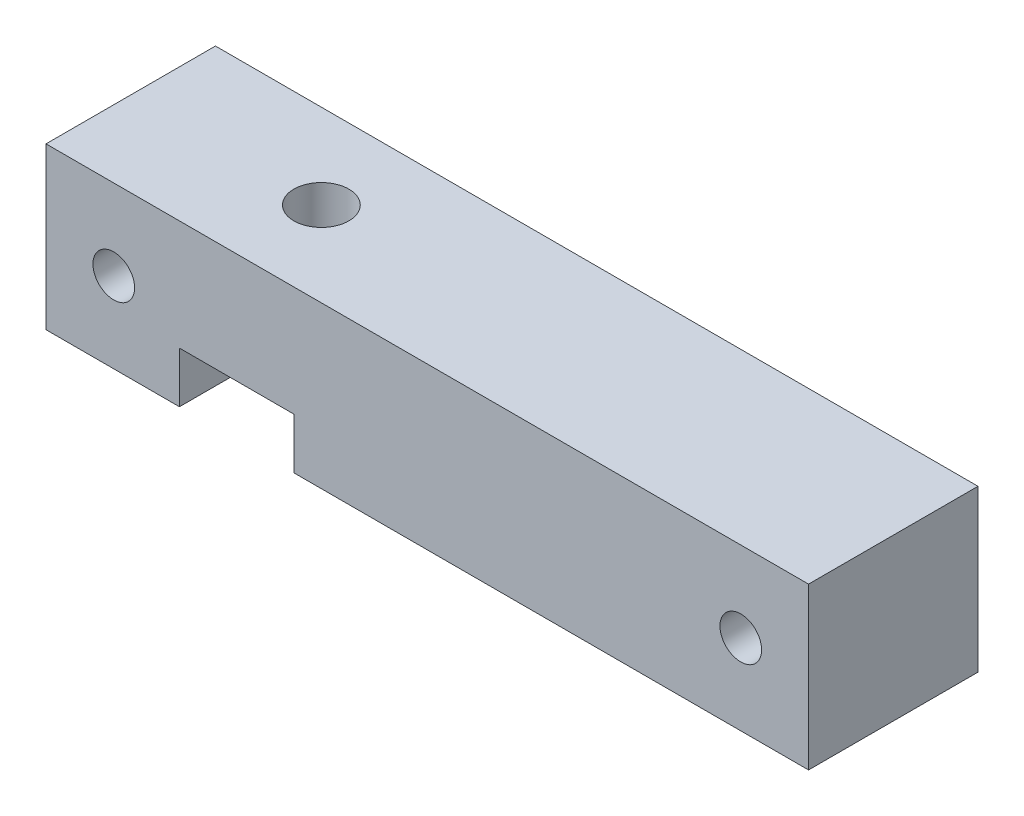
ISO-10303-21;
HEADER;
FILE_DESCRIPTION(('STEP AP214'),'2;1');
FILE_NAME('part.step','',(''),(''),'','','');
FILE_SCHEMA(('AUTOMOTIVE_DESIGN { 1 0 10303 214 1 1 1 1 }'));
ENDSEC;
DATA;
#1=APPLICATION_CONTEXT('core data for automotive mechanical design processes');
#2=APPLICATION_PROTOCOL_DEFINITION('international standard','automotive_design',2000,#1);
#3=PRODUCT_CONTEXT('',#1,'mechanical');
#4=PRODUCT('Part','Part','',(#3));
#5=PRODUCT_RELATED_PRODUCT_CATEGORY('part','',(#4));
#6=PRODUCT_DEFINITION_FORMATION('','',#4);
#7=PRODUCT_DEFINITION_CONTEXT('part definition',#1,'design');
#8=PRODUCT_DEFINITION('design','',#6,#7);
#9=PRODUCT_DEFINITION_SHAPE('','',#8);
#10=(LENGTH_UNIT() NAMED_UNIT(*) SI_UNIT(.MILLI.,.METRE.));
#11=(NAMED_UNIT(*) PLANE_ANGLE_UNIT() SI_UNIT($,.RADIAN.));
#12=(NAMED_UNIT(*) SI_UNIT($,.STERADIAN.) SOLID_ANGLE_UNIT());
#13=UNCERTAINTY_MEASURE_WITH_UNIT(LENGTH_MEASURE(1.E-05),#10,'distance_accuracy_value','');
#14=(GEOMETRIC_REPRESENTATION_CONTEXT(3) GLOBAL_UNCERTAINTY_ASSIGNED_CONTEXT((#13)) GLOBAL_UNIT_ASSIGNED_CONTEXT((#10,
#11,#12)) REPRESENTATION_CONTEXT('',''));
#15=CARTESIAN_POINT('',(0.,0.,0.));
#16=DIRECTION('',(0.,0.,1.));
#17=DIRECTION('',(1.,0.,0.));
#18=AXIS2_PLACEMENT_3D('',#15,#16,#17);
#19=CARTESIAN_POINT('',(-22.5,-1.5,-10.));
#20=DIRECTION('',(0.,-1.,0.));
#21=DIRECTION('',(0.,0.,-1.));
#22=AXIS2_PLACEMENT_3D('',#19,#20,#21);
#23=CYLINDRICAL_SURFACE('',#22,4.25);
#24=CARTESIAN_POINT('',(-22.5,0.5,-10.));
#25=DIRECTION('',(0.,-1.,0.));
#26=DIRECTION('',(0.,0.,-1.));
#27=AXIS2_PLACEMENT_3D('',#24,#25,#26);
#28=CIRCLE('',#27,4.25);
#29=CARTESIAN_POINT('',(-22.5,0.5,-14.25));
#30=VERTEX_POINT('',#29);
#31=EDGE_CURVE('E91',#30,#30,#28,.T.);
#32=ORIENTED_EDGE('',*,*,#31,.F.);
#33=EDGE_LOOP('',(#32));
#34=FACE_BOUND('',#33,.T.);
#35=CARTESIAN_POINT('',(-22.5,-3.5,-10.));
#36=DIRECTION('',(0.,-1.,0.));
#37=DIRECTION('',(0.,0.,-1.));
#38=AXIS2_PLACEMENT_3D('',#35,#36,#37);
#39=CIRCLE('',#38,4.25);
#40=CARTESIAN_POINT('',(-22.5,-3.5,-14.25));
#41=VERTEX_POINT('',#40);
#42=EDGE_CURVE('E18',#41,#41,#39,.F.);
#43=ORIENTED_EDGE('',*,*,#42,.F.);
#44=EDGE_LOOP('',(#43));
#45=FACE_BOUND('',#44,.T.);
#46=ADVANCED_FACE('F15',(#34,#45),#23,.F.);
#47=CARTESIAN_POINT('',(-15.75,-3.5,0.));
#48=DIRECTION('',(-1.,0.,0.));
#49=DIRECTION('',(0.,0.,1.));
#50=AXIS2_PLACEMENT_3D('',#47,#48,#49);
#51=PLANE('',#50);
#52=DIRECTION('',(0.,1.,0.));
#53=VECTOR('',#52,1.);
#54=CARTESIAN_POINT('',(-15.75,0.01304347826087,0.));
#55=LINE('',#54,#53);
#56=CARTESIAN_POINT('',(-15.75,-3.5,0.));
#57=VERTEX_POINT('',#56);
#58=CARTESIAN_POINT('',(-15.75,-9.5,0.));
#59=VERTEX_POINT('',#58);
#60=EDGE_CURVE('E168',#57,#59,#55,.F.);
#61=ORIENTED_EDGE('',*,*,#60,.F.);
#62=DIRECTION('',(0.,0.,-1.));
#63=VECTOR('',#62,1.);
#64=CARTESIAN_POINT('',(-15.75,-3.5,0.));
#65=LINE('',#64,#63);
#66=CARTESIAN_POINT('',(-15.75,-3.5,-20.));
#67=VERTEX_POINT('',#66);
#68=EDGE_CURVE('E97',#67,#57,#65,.F.);
#69=ORIENTED_EDGE('',*,*,#68,.F.);
#70=DIRECTION('',(0.,1.,0.));
#71=VECTOR('',#70,1.);
#72=CARTESIAN_POINT('',(-15.75,0.01304347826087,-20.));
#73=LINE('',#72,#71);
#74=CARTESIAN_POINT('',(-15.75,-9.5,-20.));
#75=VERTEX_POINT('',#74);
#76=EDGE_CURVE('E105',#67,#75,#73,.F.);
#77=ORIENTED_EDGE('',*,*,#76,.T.);
#78=DIRECTION('',(0.,0.,-1.));
#79=VECTOR('',#78,1.);
#80=CARTESIAN_POINT('',(-15.75,-9.5,0.));
#81=LINE('',#80,#79);
#82=EDGE_CURVE('E109',#59,#75,#81,.T.);
#83=ORIENTED_EDGE('',*,*,#82,.F.);
#84=EDGE_LOOP('',(#61,#69,#77,#83));
#85=FACE_BOUND('',#84,.T.);
#86=ADVANCED_FACE('F144',(#85),#51,.T.);
#87=CARTESIAN_POINT('',(-45.,-9.5,0.));
#88=DIRECTION('',(0.,-1.,0.));
#89=DIRECTION('',(0.,0.,-1.));
#90=AXIS2_PLACEMENT_3D('',#87,#88,#89);
#91=PLANE('',#90);
#92=DIRECTION('',(1.,0.,0.));
#93=VECTOR('',#92,1.);
#94=CARTESIAN_POINT('',(-1.17391304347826,-9.5,0.));
#95=LINE('',#94,#93);
#96=CARTESIAN_POINT('',(-45.,-9.5,0.));
#97=VERTEX_POINT('',#96);
#98=CARTESIAN_POINT('',(-29.25,-9.5,0.));
#99=VERTEX_POINT('',#98);
#100=EDGE_CURVE('E159',#97,#99,#95,.T.);
#101=ORIENTED_EDGE('',*,*,#100,.F.);
#102=DIRECTION('',(0.,0.,1.));
#103=VECTOR('',#102,1.);
#104=CARTESIAN_POINT('',(-45.,-9.5,0.));
#105=LINE('',#104,#103);
#106=CARTESIAN_POINT('',(-45.,-9.5,-20.));
#107=VERTEX_POINT('',#106);
#108=EDGE_CURVE('E88',#107,#97,#105,.T.);
#109=ORIENTED_EDGE('',*,*,#108,.F.);
#110=DIRECTION('',(1.,0.,0.));
#111=VECTOR('',#110,1.);
#112=CARTESIAN_POINT('',(-1.17391304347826,-9.5,-20.));
#113=LINE('',#112,#111);
#114=CARTESIAN_POINT('',(-29.25,-9.5,-20.));
#115=VERTEX_POINT('',#114);
#116=EDGE_CURVE('E83',#107,#115,#113,.T.);
#117=ORIENTED_EDGE('',*,*,#116,.T.);
#118=DIRECTION('',(0.,0.,-1.));
#119=VECTOR('',#118,1.);
#120=CARTESIAN_POINT('',(-29.25,-9.5,0.));
#121=LINE('',#120,#119);
#122=EDGE_CURVE('E86',#99,#115,#121,.T.);
#123=ORIENTED_EDGE('',*,*,#122,.F.);
#124=EDGE_LOOP('',(#101,#109,#117,#123));
#125=FACE_BOUND('',#124,.T.);
#126=ADVANCED_FACE('F85',(#125),#91,.T.);
#127=CARTESIAN_POINT('',(-29.25,-9.5,0.));
#128=DIRECTION('',(1.,0.,0.));
#129=DIRECTION('',(0.,0.,-1.));
#130=AXIS2_PLACEMENT_3D('',#127,#128,#129);
#131=PLANE('',#130);
#132=DIRECTION('',(0.,1.,0.));
#133=VECTOR('',#132,1.);
#134=CARTESIAN_POINT('',(-29.25,0.01304347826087,0.));
#135=LINE('',#134,#133);
#136=CARTESIAN_POINT('',(-29.25,-3.5,0.));
#137=VERTEX_POINT('',#136);
#138=EDGE_CURVE('E95',#99,#137,#135,.T.);
#139=ORIENTED_EDGE('',*,*,#138,.F.);
#140=ORIENTED_EDGE('',*,*,#122,.T.);
#141=DIRECTION('',(0.,1.,0.));
#142=VECTOR('',#141,1.);
#143=CARTESIAN_POINT('',(-29.25,0.01304347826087,-20.));
#144=LINE('',#143,#142);
#145=CARTESIAN_POINT('',(-29.25,-3.5,-20.));
#146=VERTEX_POINT('',#145);
#147=EDGE_CURVE('E78',#115,#146,#144,.T.);
#148=ORIENTED_EDGE('',*,*,#147,.T.);
#149=DIRECTION('',(0.,0.,-1.));
#150=VECTOR('',#149,1.);
#151=CARTESIAN_POINT('',(-29.25,-3.5,0.));
#152=LINE('',#151,#150);
#153=EDGE_CURVE('E113',#137,#146,#152,.T.);
#154=ORIENTED_EDGE('',*,*,#153,.F.);
#155=EDGE_LOOP('',(#139,#140,#148,#154));
#156=FACE_BOUND('',#155,.T.);
#157=ADVANCED_FACE('F93',(#156),#131,.T.);
#158=CARTESIAN_POINT('',(-29.25,-3.5,0.));
#159=DIRECTION('',(0.,-1.,0.));
#160=DIRECTION('',(0.,0.,-1.));
#161=AXIS2_PLACEMENT_3D('',#158,#159,#160);
#162=PLANE('',#161);
#163=ORIENTED_EDGE('',*,*,#42,.T.);
#164=EDGE_LOOP('',(#163));
#165=FACE_BOUND('',#164,.T.);
#166=DIRECTION('',(1.,0.,0.));
#167=VECTOR('',#166,1.);
#168=CARTESIAN_POINT('',(-1.17391304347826,-3.5,0.));
#169=LINE('',#168,#167);
#170=EDGE_CURVE('E129',#137,#57,#169,.T.);
#171=ORIENTED_EDGE('',*,*,#170,.F.);
#172=ORIENTED_EDGE('',*,*,#153,.T.);
#173=DIRECTION('',(1.,0.,0.));
#174=VECTOR('',#173,1.);
#175=CARTESIAN_POINT('',(-1.17391304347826,-3.5,-20.));
#176=LINE('',#175,#174);
#177=EDGE_CURVE('E103',#146,#67,#176,.T.);
#178=ORIENTED_EDGE('',*,*,#177,.T.);
#179=ORIENTED_EDGE('',*,*,#68,.T.);
#180=EDGE_LOOP('',(#171,#172,#178,#179));
#181=FACE_BOUND('',#180,.T.);
#182=ADVANCED_FACE('F148',(#165,#181),#162,.T.);
#183=CARTESIAN_POINT('',(37.,0.,-94.1328847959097));
#184=DIRECTION('',(0.,0.,1.));
#185=DIRECTION('',(1.,0.,0.));
#186=AXIS2_PLACEMENT_3D('',#183,#184,#185);
#187=CYLINDRICAL_SURFACE('',#186,2.4585);
#188=CARTESIAN_POINT('',(37.,0.,0.));
#189=DIRECTION('',(0.,0.,1.));
#190=DIRECTION('',(1.,0.,0.));
#191=AXIS2_PLACEMENT_3D('',#188,#189,#190);
#192=CIRCLE('',#191,2.4585);
#193=CARTESIAN_POINT('',(39.4585,0.,0.));
#194=VERTEX_POINT('',#193);
#195=EDGE_CURVE('E126',#194,#194,#192,.F.);
#196=ORIENTED_EDGE('',*,*,#195,.F.);
#197=EDGE_LOOP('',(#196));
#198=FACE_BOUND('',#197,.T.);
#199=CARTESIAN_POINT('',(37.,0.,-20.));
#200=DIRECTION('',(0.,0.,1.));
#201=DIRECTION('',(1.,0.,0.));
#202=AXIS2_PLACEMENT_3D('',#199,#200,#201);
#203=CIRCLE('',#202,2.4585);
#204=CARTESIAN_POINT('',(39.4585,0.,-20.));
#205=VERTEX_POINT('',#204);
#206=EDGE_CURVE('E134',#205,#205,#203,.F.);
#207=ORIENTED_EDGE('',*,*,#206,.T.);
#208=EDGE_LOOP('',(#207));
#209=FACE_BOUND('',#208,.T.);
#210=ADVANCED_FACE('F151',(#198,#209),#187,.F.);
#211=CARTESIAN_POINT('',(-37.,0.,-94.1328847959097));
#212=DIRECTION('',(0.,0.,1.));
#213=DIRECTION('',(1.,0.,0.));
#214=AXIS2_PLACEMENT_3D('',#211,#212,#213);
#215=CYLINDRICAL_SURFACE('',#214,2.4585);
#216=CARTESIAN_POINT('',(-37.,0.,0.));
#217=DIRECTION('',(0.,0.,1.));
#218=DIRECTION('',(1.,0.,0.));
#219=AXIS2_PLACEMENT_3D('',#216,#217,#218);
#220=CIRCLE('',#219,2.4585);
#221=CARTESIAN_POINT('',(-34.5415,0.,0.));
#222=VERTEX_POINT('',#221);
#223=EDGE_CURVE('E122',#222,#222,#220,.F.);
#224=ORIENTED_EDGE('',*,*,#223,.F.);
#225=EDGE_LOOP('',(#224));
#226=FACE_BOUND('',#225,.T.);
#227=CARTESIAN_POINT('',(-37.,0.,-20.));
#228=DIRECTION('',(0.,0.,1.));
#229=DIRECTION('',(1.,0.,0.));
#230=AXIS2_PLACEMENT_3D('',#227,#228,#229);
#231=CIRCLE('',#230,2.4585);
#232=CARTESIAN_POINT('',(-34.5415,0.,-20.));
#233=VERTEX_POINT('',#232);
#234=EDGE_CURVE('E130',#233,#233,#231,.F.);
#235=ORIENTED_EDGE('',*,*,#234,.T.);
#236=EDGE_LOOP('',(#235));
#237=FACE_BOUND('',#236,.T.);
#238=ADVANCED_FACE('F280',(#226,#237),#215,.F.);
#239=CARTESIAN_POINT('',(-15.75,-9.5,0.));
#240=DIRECTION('',(0.,-1.,0.));
#241=DIRECTION('',(0.,0.,-1.));
#242=AXIS2_PLACEMENT_3D('',#239,#240,#241);
#243=PLANE('',#242);
#244=DIRECTION('',(1.,0.,0.));
#245=VECTOR('',#244,1.);
#246=CARTESIAN_POINT('',(-1.17391304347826,-9.5,0.));
#247=LINE('',#246,#245);
#248=CARTESIAN_POINT('',(45.,-9.5,0.));
#249=VERTEX_POINT('',#248);
#250=EDGE_CURVE('E166',#59,#249,#247,.T.);
#251=ORIENTED_EDGE('',*,*,#250,.F.);
#252=ORIENTED_EDGE('',*,*,#82,.T.);
#253=DIRECTION('',(1.,0.,0.));
#254=VECTOR('',#253,1.);
#255=CARTESIAN_POINT('',(-1.17391304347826,-9.5,-20.));
#256=LINE('',#255,#254);
#257=CARTESIAN_POINT('',(45.,-9.5,-20.));
#258=VERTEX_POINT('',#257);
#259=EDGE_CURVE('E136',#75,#258,#256,.T.);
#260=ORIENTED_EDGE('',*,*,#259,.T.);
#261=DIRECTION('',(0.,0.,-1.));
#262=VECTOR('',#261,1.);
#263=CARTESIAN_POINT('',(45.,-9.5,0.));
#264=LINE('',#263,#262);
#265=EDGE_CURVE('E121',#249,#258,#264,.T.);
#266=ORIENTED_EDGE('',*,*,#265,.F.);
#267=EDGE_LOOP('',(#251,#252,#260,#266));
#268=FACE_BOUND('',#267,.T.);
#269=ADVANCED_FACE('F179',(#268),#243,.T.);
#270=CARTESIAN_POINT('',(-22.5,0.5,-10.));
#271=DIRECTION('',(0.,-1.,0.));
#272=DIRECTION('',(0.,0.,-1.));
#273=AXIS2_PLACEMENT_3D('',#270,#271,#272);
#274=PLANE('',#273);
#275=CARTESIAN_POINT('',(-22.5,0.5,-10.));
#276=DIRECTION('',(0.,1.,0.));
#277=DIRECTION('',(0.,0.,1.));
#278=AXIS2_PLACEMENT_3D('',#275,#276,#277);
#279=CIRCLE('',#278,3.25);
#280=CARTESIAN_POINT('',(-22.5,0.5,-6.75));
#281=VERTEX_POINT('',#280);
#282=EDGE_CURVE('E117',#281,#281,#279,.T.);
#283=ORIENTED_EDGE('',*,*,#282,.T.);
#284=EDGE_LOOP('',(#283));
#285=FACE_BOUND('',#284,.T.);
#286=ORIENTED_EDGE('',*,*,#31,.T.);
#287=EDGE_LOOP('',(#286));
#288=FACE_BOUND('',#287,.T.);
#289=ADVANCED_FACE('F140',(#285,#288),#274,.T.);
#290=CARTESIAN_POINT('',(-1.17391304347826,0.01304347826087,-20.));
#291=DIRECTION('',(0.,0.,1.));
#292=DIRECTION('',(1.,0.,0.));
#293=AXIS2_PLACEMENT_3D('',#290,#291,#292);
#294=PLANE('',#293);
#295=ORIENTED_EDGE('',*,*,#234,.F.);
#296=EDGE_LOOP('',(#295));
#297=FACE_BOUND('',#296,.T.);
#298=ORIENTED_EDGE('',*,*,#206,.F.);
#299=EDGE_LOOP('',(#298));
#300=FACE_BOUND('',#299,.T.);
#301=ORIENTED_EDGE('',*,*,#76,.F.);
#302=ORIENTED_EDGE('',*,*,#177,.F.);
#303=ORIENTED_EDGE('',*,*,#147,.F.);
#304=ORIENTED_EDGE('',*,*,#116,.F.);
#305=DIRECTION('',(0.,1.,0.));
#306=VECTOR('',#305,1.);
#307=CARTESIAN_POINT('',(-45.,9.5,-20.));
#308=LINE('',#307,#306);
#309=CARTESIAN_POINT('',(-45.,9.5,-20.));
#310=VERTEX_POINT('',#309);
#311=EDGE_CURVE('E133',#310,#107,#308,.F.);
#312=ORIENTED_EDGE('',*,*,#311,.F.);
#313=DIRECTION('',(1.,0.,0.));
#314=VECTOR('',#313,1.);
#315=CARTESIAN_POINT('',(45.,9.5,-20.));
#316=LINE('',#315,#314);
#317=CARTESIAN_POINT('',(45.,9.5,-20.));
#318=VERTEX_POINT('',#317);
#319=EDGE_CURVE('E120',#318,#310,#316,.F.);
#320=ORIENTED_EDGE('',*,*,#319,.F.);
#321=DIRECTION('',(0.,1.,0.));
#322=VECTOR('',#321,1.);
#323=CARTESIAN_POINT('',(45.,-9.5,-20.));
#324=LINE('',#323,#322);
#325=EDGE_CURVE('E125',#258,#318,#324,.T.);
#326=ORIENTED_EDGE('',*,*,#325,.F.);
#327=ORIENTED_EDGE('',*,*,#259,.F.);
#328=EDGE_LOOP('',(#301,#302,#303,#304,#312,#320,#326,#327));
#329=FACE_BOUND('',#328,.T.);
#330=ADVANCED_FACE('F101',(#297,#300,#329),#294,.F.);
#331=CARTESIAN_POINT('',(-45.,9.5,0.));
#332=DIRECTION('',(-1.,0.,0.));
#333=DIRECTION('',(0.,0.,1.));
#334=AXIS2_PLACEMENT_3D('',#331,#332,#333);
#335=PLANE('',#334);
#336=DIRECTION('',(0.,1.,0.));
#337=VECTOR('',#336,1.);
#338=CARTESIAN_POINT('',(-45.,0.01304347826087,0.));
#339=LINE('',#338,#337);
#340=CARTESIAN_POINT('',(-45.,9.5,0.));
#341=VERTEX_POINT('',#340);
#342=EDGE_CURVE('E161',#341,#97,#339,.F.);
#343=ORIENTED_EDGE('',*,*,#342,.F.);
#344=DIRECTION('',(0.,0.,1.));
#345=VECTOR('',#344,1.);
#346=CARTESIAN_POINT('',(-45.,9.5,0.));
#347=LINE('',#346,#345);
#348=EDGE_CURVE('E192',#310,#341,#347,.T.);
#349=ORIENTED_EDGE('',*,*,#348,.F.);
#350=ORIENTED_EDGE('',*,*,#311,.T.);
#351=ORIENTED_EDGE('',*,*,#108,.T.);
#352=EDGE_LOOP('',(#343,#349,#350,#351));
#353=FACE_BOUND('',#352,.T.);
#354=ADVANCED_FACE('F203',(#353),#335,.T.);
#355=CARTESIAN_POINT('',(-1.17391304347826,0.01304347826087,0.));
#356=DIRECTION('',(0.,0.,1.));
#357=DIRECTION('',(1.,0.,0.));
#358=AXIS2_PLACEMENT_3D('',#355,#356,#357);
#359=PLANE('',#358);
#360=ORIENTED_EDGE('',*,*,#223,.T.);
#361=EDGE_LOOP('',(#360));
#362=FACE_BOUND('',#361,.T.);
#363=ORIENTED_EDGE('',*,*,#195,.T.);
#364=EDGE_LOOP('',(#363));
#365=FACE_BOUND('',#364,.T.);
#366=ORIENTED_EDGE('',*,*,#138,.T.);
#367=ORIENTED_EDGE('',*,*,#170,.T.);
#368=ORIENTED_EDGE('',*,*,#60,.T.);
#369=ORIENTED_EDGE('',*,*,#250,.T.);
#370=DIRECTION('',(0.,1.,0.));
#371=VECTOR('',#370,1.);
#372=CARTESIAN_POINT('',(45.,-9.5,0.));
#373=LINE('',#372,#371);
#374=CARTESIAN_POINT('',(45.,9.5,0.));
#375=VERTEX_POINT('',#374);
#376=EDGE_CURVE('E33',#375,#249,#373,.F.);
#377=ORIENTED_EDGE('',*,*,#376,.F.);
#378=DIRECTION('',(1.,0.,0.));
#379=VECTOR('',#378,1.);
#380=CARTESIAN_POINT('',(45.,9.5,0.));
#381=LINE('',#380,#379);
#382=EDGE_CURVE('E195',#341,#375,#381,.T.);
#383=ORIENTED_EDGE('',*,*,#382,.F.);
#384=ORIENTED_EDGE('',*,*,#342,.T.);
#385=ORIENTED_EDGE('',*,*,#100,.T.);
#386=EDGE_LOOP('',(#366,#367,#368,#369,#377,#383,#384,#385));
#387=FACE_BOUND('',#386,.T.);
#388=ADVANCED_FACE('F157',(#362,#365,#387),#359,.T.);
#389=CARTESIAN_POINT('',(45.,-9.5,0.));
#390=DIRECTION('',(1.,0.,0.));
#391=DIRECTION('',(0.,0.,-1.));
#392=AXIS2_PLACEMENT_3D('',#389,#390,#391);
#393=PLANE('',#392);
#394=ORIENTED_EDGE('',*,*,#376,.T.);
#395=ORIENTED_EDGE('',*,*,#265,.T.);
#396=ORIENTED_EDGE('',*,*,#325,.T.);
#397=DIRECTION('',(0.,0.,1.));
#398=VECTOR('',#397,1.);
#399=CARTESIAN_POINT('',(45.,9.5,0.));
#400=LINE('',#399,#398);
#401=EDGE_CURVE('E24',#375,#318,#400,.F.);
#402=ORIENTED_EDGE('',*,*,#401,.F.);
#403=EDGE_LOOP('',(#394,#395,#396,#402));
#404=FACE_BOUND('',#403,.T.);
#405=ADVANCED_FACE('F187',(#404),#393,.T.);
#406=CARTESIAN_POINT('',(-22.5,-3.5,-10.));
#407=DIRECTION('',(0.,1.,0.));
#408=DIRECTION('',(0.,0.,1.));
#409=AXIS2_PLACEMENT_3D('',#406,#407,#408);
#410=CYLINDRICAL_SURFACE('',#409,3.25);
#411=CARTESIAN_POINT('',(-22.5,9.5,-10.));
#412=DIRECTION('',(0.,1.,0.));
#413=DIRECTION('',(0.,0.,1.));
#414=AXIS2_PLACEMENT_3D('',#411,#412,#413);
#415=CIRCLE('',#414,3.25);
#416=CARTESIAN_POINT('',(-22.5,9.5,-6.75));
#417=VERTEX_POINT('',#416);
#418=EDGE_CURVE('E10',#417,#417,#415,.F.);
#419=ORIENTED_EDGE('',*,*,#418,.F.);
#420=EDGE_LOOP('',(#419));
#421=FACE_BOUND('',#420,.T.);
#422=ORIENTED_EDGE('',*,*,#282,.F.);
#423=EDGE_LOOP('',(#422));
#424=FACE_BOUND('',#423,.T.);
#425=ADVANCED_FACE('F218',(#421,#424),#410,.F.);
#426=CARTESIAN_POINT('',(45.,9.5,0.));
#427=DIRECTION('',(0.,1.,0.));
#428=DIRECTION('',(0.,0.,1.));
#429=AXIS2_PLACEMENT_3D('',#426,#427,#428);
#430=PLANE('',#429);
#431=ORIENTED_EDGE('',*,*,#418,.T.);
#432=EDGE_LOOP('',(#431));
#433=FACE_BOUND('',#432,.T.);
#434=ORIENTED_EDGE('',*,*,#382,.T.);
#435=ORIENTED_EDGE('',*,*,#401,.T.);
#436=ORIENTED_EDGE('',*,*,#319,.T.);
#437=ORIENTED_EDGE('',*,*,#348,.T.);
#438=EDGE_LOOP('',(#434,#435,#436,#437));
#439=FACE_BOUND('',#438,.T.);
#440=ADVANCED_FACE('F200',(#433,#439),#430,.T.);
#441=CLOSED_SHELL('',(#46,#86,#126,#157,#182,#210,#238,#269,#289,#330,#354,#388,#405,#425,#440));
#442=MANIFOLD_SOLID_BREP('B1',#441);
#443=ADVANCED_BREP_SHAPE_REPRESENTATION('',(#18,#442),#14);
#444=SHAPE_DEFINITION_REPRESENTATION(#9,#443);
ENDSEC;
END-ISO-10303-21;
